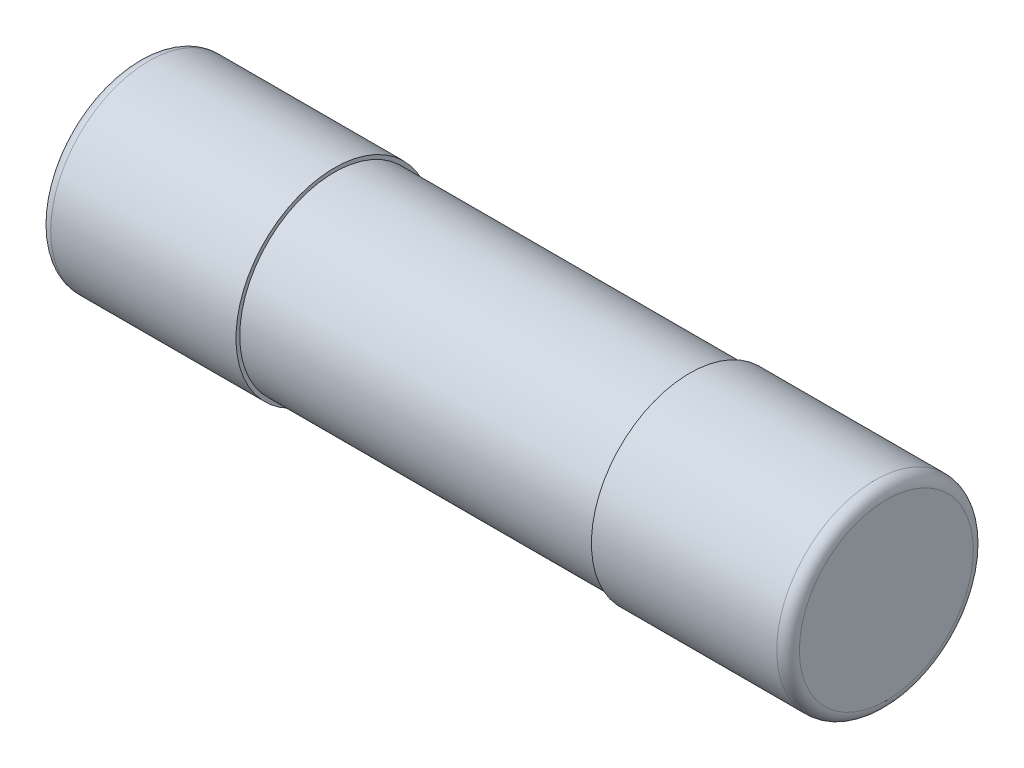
from build123d import *

# Parameters (mm, degrees)
ESQUISSE1_R           = 2.5
BOSS_EXTRU_1_DEPTH    = 4.7
ESQUISSE2_R           = 2.6
BOSS_EXTRU_2_DEPTH    = 5.2
CONG_1_R              = 0.3
CONG_1_OF_SYM_TRIE1_R = 0.3


with BuildPart() as part:
    # Esquisse1 → Boss.-Extru.1 (new, symmetric)
    with BuildSketch(Plane(origin=(0, 0, 0), x_dir=(0, 0, -1), z_dir=(1, 0, 0))):
        Circle(ESQUISSE1_R)
    extrude(amount=BOSS_EXTRU_1_DEPTH, both=True)

    # Esquisse2 → Boss.-Extru.2 (add)
    with BuildSketch(Plane(origin=(4.7, 0, 0), x_dir=(0, 0, -1), z_dir=(1, 0, 0))):
        Circle(ESQUISSE2_R)
    boss_extru_2 = extrude(amount=BOSS_EXTRU_2_DEPTH)

    # Cong_1
    cong_1_edges = [part.edges().sort_by_distance(p)[0] for p in [
        (9.9, 0, 2.6),
    ]]
    fillet(cong_1_edges, radius=CONG_1_R)

    # Sym_trie1: Boss.-Extru.2 across plane
    add(boss_extru_2.mirror(Plane(origin=(0, 0, 0), x_dir=(0, 0, 1), z_dir=(1, 0, 0))))

    # Cong_1 of Sym_trie1
    cong_1_of_sym_trie1_edges = [part.edges().sort_by_distance(p)[0] for p in [
        (-9.9, 0, 2.6),
    ]]
    fillet(cong_1_of_sym_trie1_edges, radius=CONG_1_OF_SYM_TRIE1_R)


solid = part.part
